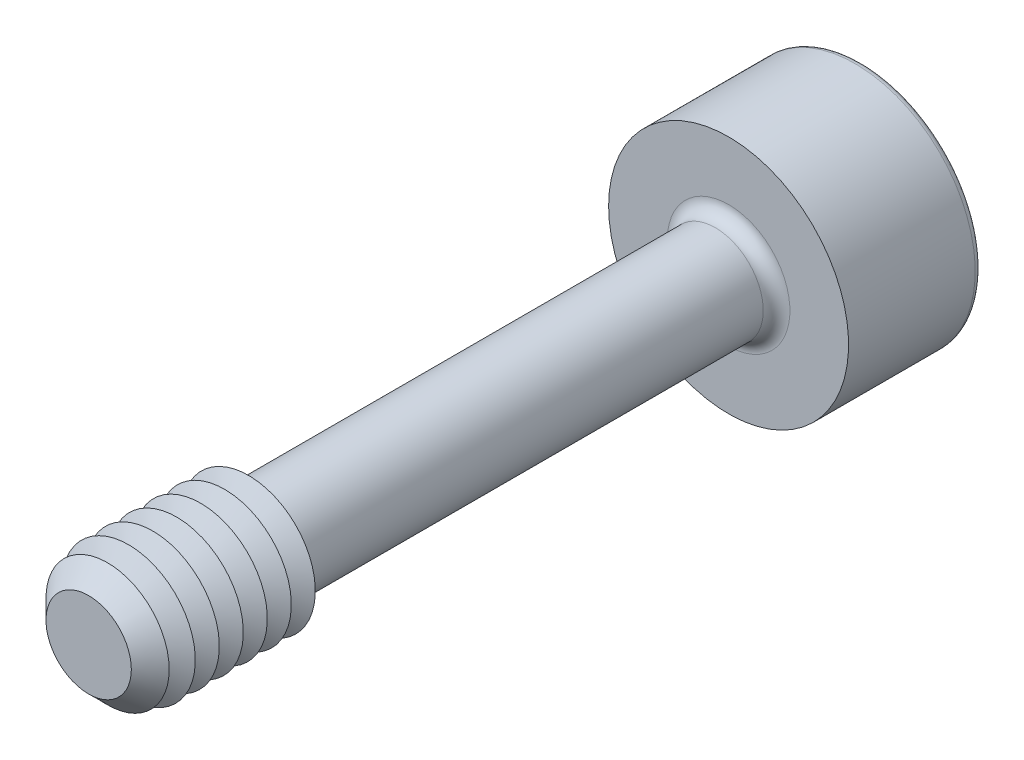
ISO-10303-21;
HEADER;
FILE_DESCRIPTION(('STEP AP214'),'2;1');
FILE_NAME('part.step','',(''),(''),'','','');
FILE_SCHEMA(('AUTOMOTIVE_DESIGN { 1 0 10303 214 1 1 1 1 }'));
ENDSEC;
DATA;
#1=APPLICATION_CONTEXT('core data for automotive mechanical design processes');
#2=APPLICATION_PROTOCOL_DEFINITION('international standard','automotive_design',2000,#1);
#3=PRODUCT_CONTEXT('',#1,'mechanical');
#4=PRODUCT('Part','Part','',(#3));
#5=PRODUCT_RELATED_PRODUCT_CATEGORY('part','',(#4));
#6=PRODUCT_DEFINITION_FORMATION('','',#4);
#7=PRODUCT_DEFINITION_CONTEXT('part definition',#1,'design');
#8=PRODUCT_DEFINITION('design','',#6,#7);
#9=PRODUCT_DEFINITION_SHAPE('','',#8);
#10=(LENGTH_UNIT() NAMED_UNIT(*) SI_UNIT(.MILLI.,.METRE.));
#11=(NAMED_UNIT(*) PLANE_ANGLE_UNIT() SI_UNIT($,.RADIAN.));
#12=(NAMED_UNIT(*) SI_UNIT($,.STERADIAN.) SOLID_ANGLE_UNIT());
#13=UNCERTAINTY_MEASURE_WITH_UNIT(LENGTH_MEASURE(1.E-05),#10,'distance_accuracy_value','');
#14=(GEOMETRIC_REPRESENTATION_CONTEXT(3) GLOBAL_UNCERTAINTY_ASSIGNED_CONTEXT((#13)) GLOBAL_UNIT_ASSIGNED_CONTEXT((#10,
#11,#12)) REPRESENTATION_CONTEXT('',''));
#15=CARTESIAN_POINT('',(0.,0.,0.));
#16=DIRECTION('',(0.,0.,1.));
#17=DIRECTION('',(1.,0.,0.));
#18=AXIS2_PLACEMENT_3D('',#15,#16,#17);
#19=CARTESIAN_POINT('',(-0.577350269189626,-0.999999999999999,-6.5));
#20=DIRECTION('',(0.,0.,1.));
#21=DIRECTION('',(1.,0.,0.));
#22=AXIS2_PLACEMENT_3D('',#19,#20,#21);
#23=PLANE('',#22);
#24=DIRECTION('',(1.,0.,0.));
#25=VECTOR('',#24,1.);
#26=CARTESIAN_POINT('',(-0.577350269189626,-0.999999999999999,-6.5));
#27=LINE('',#26,#25);
#28=CARTESIAN_POINT('',(0.,-0.999999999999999,-6.5));
#29=VERTEX_POINT('',#28);
#30=CARTESIAN_POINT('',(0.577350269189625,-0.999999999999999,-6.5));
#31=VERTEX_POINT('',#30);
#32=EDGE_CURVE('E693',#29,#31,#27,.T.);
#33=ORIENTED_EDGE('',*,*,#32,.F.);
#34=CARTESIAN_POINT('',(0.,0.,-6.5));
#35=DIRECTION('',(0.,0.,1.));
#36=DIRECTION('',(0.,-1.,0.));
#37=AXIS2_PLACEMENT_3D('',#34,#35,#36);
#38=CIRCLE('',#37,1.);
#39=CARTESIAN_POINT('',(0.866025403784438,-0.499999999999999,-6.5));
#40=VERTEX_POINT('',#39);
#41=EDGE_CURVE('E53',#29,#40,#38,.T.);
#42=ORIENTED_EDGE('',*,*,#41,.T.);
#43=DIRECTION('',(0.5,0.866025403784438,0.));
#44=VECTOR('',#43,1.);
#45=CARTESIAN_POINT('',(0.577350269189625,-0.999999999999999,-6.5));
#46=LINE('',#45,#44);
#47=EDGE_CURVE('E680',#31,#40,#46,.T.);
#48=ORIENTED_EDGE('',*,*,#47,.F.);
#49=EDGE_LOOP('',(#33,#42,#48));
#50=FACE_BOUND('',#49,.T.);
#51=ADVANCED_FACE('F41',(#50),#23,.F.);
#52=CARTESIAN_POINT('',(1.15470053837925,0.,-6.5));
#53=VERTEX_POINT('',#52);
#54=EDGE_CURVE('E689',#40,#53,#46,.T.);
#55=ORIENTED_EDGE('',*,*,#54,.F.);
#56=CARTESIAN_POINT('',(0.866025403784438,0.500000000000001,-6.5));
#57=VERTEX_POINT('',#56);
#58=EDGE_CURVE('E11',#40,#57,#38,.T.);
#59=ORIENTED_EDGE('',*,*,#58,.T.);
#60=DIRECTION('',(-0.5,0.866025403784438,0.));
#61=VECTOR('',#60,1.);
#62=CARTESIAN_POINT('',(1.15470053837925,0.,-6.5));
#63=LINE('',#62,#61);
#64=EDGE_CURVE('E679',#53,#57,#63,.T.);
#65=ORIENTED_EDGE('',*,*,#64,.F.);
#66=EDGE_LOOP('',(#55,#59,#65));
#67=FACE_BOUND('',#66,.T.);
#68=ADVANCED_FACE('F133',(#67),#23,.F.);
#69=CARTESIAN_POINT('',(0.577350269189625,1.,-6.5));
#70=VERTEX_POINT('',#69);
#71=EDGE_CURVE('E674',#57,#70,#63,.T.);
#72=ORIENTED_EDGE('',*,*,#71,.F.);
#73=CARTESIAN_POINT('',(0.,1.,-6.5));
#74=VERTEX_POINT('',#73);
#75=EDGE_CURVE('E51',#57,#74,#38,.T.);
#76=ORIENTED_EDGE('',*,*,#75,.T.);
#77=DIRECTION('',(-1.,0.,0.));
#78=VECTOR('',#77,1.);
#79=CARTESIAN_POINT('',(0.577350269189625,1.,-6.5));
#80=LINE('',#79,#78);
#81=EDGE_CURVE('E177',#70,#74,#80,.T.);
#82=ORIENTED_EDGE('',*,*,#81,.F.);
#83=EDGE_LOOP('',(#72,#76,#82));
#84=FACE_BOUND('',#83,.T.);
#85=ADVANCED_FACE('F139',(#84),#23,.F.);
#86=CARTESIAN_POINT('',(-0.577350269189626,1.,-6.5));
#87=VERTEX_POINT('',#86);
#88=EDGE_CURVE('E684',#74,#87,#80,.T.);
#89=ORIENTED_EDGE('',*,*,#88,.F.);
#90=CARTESIAN_POINT('',(-0.866025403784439,0.500000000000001,-6.5));
#91=VERTEX_POINT('',#90);
#92=EDGE_CURVE('E262',#74,#91,#38,.T.);
#93=ORIENTED_EDGE('',*,*,#92,.T.);
#94=DIRECTION('',(-0.5,-0.866025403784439,0.));
#95=VECTOR('',#94,1.);
#96=CARTESIAN_POINT('',(-0.577350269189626,1.,-6.5));
#97=LINE('',#96,#95);
#98=EDGE_CURVE('E176',#87,#91,#97,.T.);
#99=ORIENTED_EDGE('',*,*,#98,.F.);
#100=EDGE_LOOP('',(#89,#93,#99));
#101=FACE_BOUND('',#100,.T.);
#102=ADVANCED_FACE('F157',(#101),#23,.F.);
#103=CARTESIAN_POINT('',(-1.15470053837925,0.,-6.5));
#104=VERTEX_POINT('',#103);
#105=EDGE_CURVE('E170',#91,#104,#97,.T.);
#106=ORIENTED_EDGE('',*,*,#105,.F.);
#107=CARTESIAN_POINT('',(-0.866025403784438,-0.5,-6.5));
#108=VERTEX_POINT('',#107);
#109=EDGE_CURVE('E172',#91,#108,#38,.T.);
#110=ORIENTED_EDGE('',*,*,#109,.T.);
#111=DIRECTION('',(0.500000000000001,-0.866025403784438,0.));
#112=VECTOR('',#111,1.);
#113=CARTESIAN_POINT('',(-1.15470053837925,0.,-6.5));
#114=LINE('',#113,#112);
#115=EDGE_CURVE('E174',#104,#108,#114,.T.);
#116=ORIENTED_EDGE('',*,*,#115,.F.);
#117=EDGE_LOOP('',(#106,#110,#116));
#118=FACE_BOUND('',#117,.T.);
#119=ADVANCED_FACE('F146',(#118),#23,.F.);
#120=CARTESIAN_POINT('',(0.,0.,-8.5));
#121=DIRECTION('',(0.,0.,-1.));
#122=DIRECTION('',(-1.,0.,0.));
#123=AXIS2_PLACEMENT_3D('',#120,#121,#122);
#124=PLANE('',#123);
#125=CARTESIAN_POINT('',(0.,0.,-8.5));
#126=DIRECTION('',(0.,0.,-1.));
#127=DIRECTION('',(-1.,0.,0.));
#128=AXIS2_PLACEMENT_3D('',#125,#126,#127);
#129=CIRCLE('',#128,2.125);
#130=CARTESIAN_POINT('',(-2.125,0.,-8.5));
#131=VERTEX_POINT('',#130);
#132=EDGE_CURVE('E251',#131,#131,#129,.T.);
#133=ORIENTED_EDGE('',*,*,#132,.T.);
#134=EDGE_LOOP('',(#133));
#135=FACE_BOUND('',#134,.T.);
#136=DIRECTION('',(-0.5,-0.866025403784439,0.));
#137=VECTOR('',#136,1.);
#138=CARTESIAN_POINT('',(-0.577350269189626,1.,-8.5));
#139=LINE('',#138,#137);
#140=CARTESIAN_POINT('',(-0.577350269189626,1.,-8.5));
#141=VERTEX_POINT('',#140);
#142=CARTESIAN_POINT('',(-1.15470053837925,0.,-8.5));
#143=VERTEX_POINT('',#142);
#144=EDGE_CURVE('E212',#141,#143,#139,.T.);
#145=ORIENTED_EDGE('',*,*,#144,.T.);
#146=DIRECTION('',(0.500000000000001,-0.866025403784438,0.));
#147=VECTOR('',#146,1.);
#148=CARTESIAN_POINT('',(-1.15470053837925,0.,-8.5));
#149=LINE('',#148,#147);
#150=CARTESIAN_POINT('',(-0.577350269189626,-0.999999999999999,-8.5));
#151=VERTEX_POINT('',#150);
#152=EDGE_CURVE('E67',#143,#151,#149,.T.);
#153=ORIENTED_EDGE('',*,*,#152,.T.);
#154=DIRECTION('',(1.,0.,0.));
#155=VECTOR('',#154,1.);
#156=CARTESIAN_POINT('',(-0.577350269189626,-0.999999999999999,-8.5));
#157=LINE('',#156,#155);
#158=CARTESIAN_POINT('',(0.577350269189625,-0.999999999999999,-8.5));
#159=VERTEX_POINT('',#158);
#160=EDGE_CURVE('E196',#151,#159,#157,.T.);
#161=ORIENTED_EDGE('',*,*,#160,.T.);
#162=DIRECTION('',(0.5,0.866025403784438,0.));
#163=VECTOR('',#162,1.);
#164=CARTESIAN_POINT('',(0.577350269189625,-0.999999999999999,-8.5));
#165=LINE('',#164,#163);
#166=CARTESIAN_POINT('',(1.15470053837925,0.,-8.5));
#167=VERTEX_POINT('',#166);
#168=EDGE_CURVE('E200',#159,#167,#165,.T.);
#169=ORIENTED_EDGE('',*,*,#168,.T.);
#170=DIRECTION('',(-0.5,0.866025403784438,0.));
#171=VECTOR('',#170,1.);
#172=CARTESIAN_POINT('',(1.15470053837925,0.,-8.5));
#173=LINE('',#172,#171);
#174=CARTESIAN_POINT('',(0.577350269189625,1.,-8.5));
#175=VERTEX_POINT('',#174);
#176=EDGE_CURVE('E204',#167,#175,#173,.T.);
#177=ORIENTED_EDGE('',*,*,#176,.T.);
#178=DIRECTION('',(-1.,0.,0.));
#179=VECTOR('',#178,1.);
#180=CARTESIAN_POINT('',(0.577350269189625,1.,-8.5));
#181=LINE('',#180,#179);
#182=EDGE_CURVE('E208',#175,#141,#181,.T.);
#183=ORIENTED_EDGE('',*,*,#182,.T.);
#184=EDGE_LOOP('',(#145,#153,#161,#169,#177,#183));
#185=FACE_BOUND('',#184,.T.);
#186=ADVANCED_FACE('F156',(#135,#185),#124,.T.);
#187=CARTESIAN_POINT('',(0.,0.,6.));
#188=DIRECTION('',(0.,0.,-1.));
#189=DIRECTION('',(-1.,0.,0.));
#190=AXIS2_PLACEMENT_3D('',#187,#188,#189);
#191=CYLINDRICAL_SURFACE('',#190,0.9);
#192=CARTESIAN_POINT('',(0.,0.,-5.75));
#193=DIRECTION('',(0.,0.,-1.));
#194=DIRECTION('',(-1.,0.,0.));
#195=AXIS2_PLACEMENT_3D('',#192,#193,#194);
#196=CIRCLE('',#195,0.9);
#197=CARTESIAN_POINT('',(-0.9,0.,-5.75));
#198=VERTEX_POINT('',#197);
#199=EDGE_CURVE('E247',#198,#198,#196,.F.);
#200=ORIENTED_EDGE('',*,*,#199,.T.);
#201=EDGE_LOOP('',(#200));
#202=FACE_BOUND('',#201,.T.);
#203=CARTESIAN_POINT('',(0.,0.,2.79792740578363));
#204=DIRECTION('',(0.,0.,-1.));
#205=DIRECTION('',(0.,1.,0.));
#206=AXIS2_PLACEMENT_3D('',#203,#204,#205);
#207=CIRCLE('',#206,0.9);
#208=CARTESIAN_POINT('',(0.,0.9,2.79792740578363));
#209=VERTEX_POINT('',#208);
#210=EDGE_CURVE('E235',#209,#209,#207,.T.);
#211=ORIENTED_EDGE('',*,*,#210,.T.);
#212=EDGE_LOOP('',(#211));
#213=FACE_BOUND('',#212,.T.);
#214=ADVANCED_FACE('F163',(#202,#213),#191,.T.);
#215=CARTESIAN_POINT('',(0.,0.,2.79792740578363));
#216=DIRECTION('',(0.,0.,1.));
#217=DIRECTION('',(0.,-1.,0.));
#218=AXIS2_PLACEMENT_3D('',#215,#216,#217);
#219=CONICAL_SURFACE('',#218,0.9,1.0471975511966);
#220=CARTESIAN_POINT('',(0.,0.,3.));
#221=DIRECTION('',(0.,0.,-1.));
#222=DIRECTION('',(-1.,0.,0.));
#223=AXIS2_PLACEMENT_3D('',#220,#221,#222);
#224=CIRCLE('',#223,1.25);
#225=CARTESIAN_POINT('',(-1.25,0.,3.));
#226=VERTEX_POINT('',#225);
#227=EDGE_CURVE('E266',#226,#226,#224,.T.);
#228=ORIENTED_EDGE('',*,*,#227,.T.);
#229=EDGE_LOOP('',(#228));
#230=FACE_BOUND('',#229,.T.);
#231=ORIENTED_EDGE('',*,*,#210,.F.);
#232=EDGE_LOOP('',(#231));
#233=FACE_BOUND('',#232,.T.);
#234=ADVANCED_FACE('F459',(#230,#233),#219,.T.);
#235=CARTESIAN_POINT('',(0.,0.,-6.));
#236=DIRECTION('',(0.,0.,-1.));
#237=DIRECTION('',(-1.,0.,0.));
#238=AXIS2_PLACEMENT_3D('',#235,#236,#237);
#239=PLANE('',#238);
#240=CARTESIAN_POINT('',(0.,0.,-6.));
#241=DIRECTION('',(0.,0.,-1.));
#242=DIRECTION('',(-1.,0.,0.));
#243=AXIS2_PLACEMENT_3D('',#240,#241,#242);
#244=CIRCLE('',#243,1.15);
#245=CARTESIAN_POINT('',(-1.15,0.,-6.));
#246=VERTEX_POINT('',#245);
#247=EDGE_CURVE('E243',#246,#246,#244,.T.);
#248=ORIENTED_EDGE('',*,*,#247,.T.);
#249=EDGE_LOOP('',(#248));
#250=FACE_BOUND('',#249,.T.);
#251=CARTESIAN_POINT('',(0.,0.,-6.));
#252=DIRECTION('',(0.,0.,-1.));
#253=DIRECTION('',(-1.,0.,0.));
#254=AXIS2_PLACEMENT_3D('',#251,#252,#253);
#255=CIRCLE('',#254,2.25);
#256=CARTESIAN_POINT('',(-2.25,0.,-6.));
#257=VERTEX_POINT('',#256);
#258=EDGE_CURVE('E231',#257,#257,#255,.T.);
#259=ORIENTED_EDGE('',*,*,#258,.F.);
#260=EDGE_LOOP('',(#259));
#261=FACE_BOUND('',#260,.T.);
#262=ADVANCED_FACE('F452',(#250,#261),#239,.F.);
#263=CARTESIAN_POINT('',(0.,0.,-8.5));
#264=DIRECTION('',(0.,0.,1.));
#265=DIRECTION('',(1.,0.,0.));
#266=AXIS2_PLACEMENT_3D('',#263,#264,#265);
#267=CYLINDRICAL_SURFACE('',#266,2.25);
#268=CARTESIAN_POINT('',(0.,0.,-8.375));
#269=DIRECTION('',(0.,0.,-1.));
#270=DIRECTION('',(-1.,0.,0.));
#271=AXIS2_PLACEMENT_3D('',#268,#269,#270);
#272=CIRCLE('',#271,2.25);
#273=CARTESIAN_POINT('',(-2.25,0.,-8.375));
#274=VERTEX_POINT('',#273);
#275=EDGE_CURVE('E254',#274,#274,#272,.F.);
#276=ORIENTED_EDGE('',*,*,#275,.T.);
#277=EDGE_LOOP('',(#276));
#278=FACE_BOUND('',#277,.T.);
#279=ORIENTED_EDGE('',*,*,#258,.T.);
#280=EDGE_LOOP('',(#279));
#281=FACE_BOUND('',#280,.T.);
#282=ADVANCED_FACE('F458',(#278,#281),#267,.T.);
#283=CARTESIAN_POINT('',(-1.15470053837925,0.,-6.5));
#284=DIRECTION('',(0.866025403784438,0.500000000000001,0.));
#285=DIRECTION('',(-0.500000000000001,0.866025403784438,0.));
#286=AXIS2_PLACEMENT_3D('',#283,#284,#285);
#287=PLANE('',#286);
#288=ORIENTED_EDGE('',*,*,#152,.F.);
#289=DIRECTION('',(0.,0.,-1.));
#290=VECTOR('',#289,1.);
#291=CARTESIAN_POINT('',(-1.15470053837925,0.,-6.5));
#292=LINE('',#291,#290);
#293=EDGE_CURVE('E186',#104,#143,#292,.T.);
#294=ORIENTED_EDGE('',*,*,#293,.F.);
#295=ORIENTED_EDGE('',*,*,#115,.T.);
#296=CARTESIAN_POINT('',(-0.577350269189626,-0.999999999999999,-6.5));
#297=VERTEX_POINT('',#296);
#298=EDGE_CURVE('E215',#108,#297,#114,.T.);
#299=ORIENTED_EDGE('',*,*,#298,.T.);
#300=DIRECTION('',(0.,0.,-1.));
#301=VECTOR('',#300,1.);
#302=CARTESIAN_POINT('',(-0.577350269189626,-0.999999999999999,-6.5));
#303=LINE('',#302,#301);
#304=EDGE_CURVE('E228',#297,#151,#303,.T.);
#305=ORIENTED_EDGE('',*,*,#304,.T.);
#306=EDGE_LOOP('',(#288,#294,#295,#299,#305));
#307=FACE_BOUND('',#306,.T.);
#308=ADVANCED_FACE('F470',(#307),#287,.T.);
#309=CARTESIAN_POINT('',(-0.577350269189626,-0.999999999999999,-6.5));
#310=DIRECTION('',(0.,1.,0.));
#311=DIRECTION('',(-1.,0.,0.));
#312=AXIS2_PLACEMENT_3D('',#309,#310,#311);
#313=PLANE('',#312);
#314=ORIENTED_EDGE('',*,*,#160,.F.);
#315=ORIENTED_EDGE('',*,*,#304,.F.);
#316=EDGE_CURVE('E690',#297,#29,#27,.T.);
#317=ORIENTED_EDGE('',*,*,#316,.T.);
#318=ORIENTED_EDGE('',*,*,#32,.T.);
#319=DIRECTION('',(0.,0.,-1.));
#320=VECTOR('',#319,1.);
#321=CARTESIAN_POINT('',(0.577350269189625,-0.999999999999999,-6.5));
#322=LINE('',#321,#320);
#323=EDGE_CURVE('E225',#31,#159,#322,.T.);
#324=ORIENTED_EDGE('',*,*,#323,.T.);
#325=EDGE_LOOP('',(#314,#315,#317,#318,#324));
#326=FACE_BOUND('',#325,.T.);
#327=ADVANCED_FACE('F486',(#326),#313,.T.);
#328=CARTESIAN_POINT('',(0.577350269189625,-0.999999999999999,-6.5));
#329=DIRECTION('',(-0.866025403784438,0.5,0.));
#330=DIRECTION('',(-0.5,-0.866025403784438,0.));
#331=AXIS2_PLACEMENT_3D('',#328,#329,#330);
#332=PLANE('',#331);
#333=ORIENTED_EDGE('',*,*,#168,.F.);
#334=ORIENTED_EDGE('',*,*,#323,.F.);
#335=ORIENTED_EDGE('',*,*,#47,.T.);
#336=ORIENTED_EDGE('',*,*,#54,.T.);
#337=DIRECTION('',(0.,0.,-1.));
#338=VECTOR('',#337,1.);
#339=CARTESIAN_POINT('',(1.15470053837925,0.,-6.5));
#340=LINE('',#339,#338);
#341=EDGE_CURVE('E222',#53,#167,#340,.T.);
#342=ORIENTED_EDGE('',*,*,#341,.T.);
#343=EDGE_LOOP('',(#333,#334,#335,#336,#342));
#344=FACE_BOUND('',#343,.T.);
#345=ADVANCED_FACE('F496',(#344),#332,.T.);
#346=CARTESIAN_POINT('',(1.15470053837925,0.,-6.5));
#347=DIRECTION('',(-0.866025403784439,-0.5,0.));
#348=DIRECTION('',(0.5,-0.866025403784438,0.));
#349=AXIS2_PLACEMENT_3D('',#346,#347,#348);
#350=PLANE('',#349);
#351=ORIENTED_EDGE('',*,*,#176,.F.);
#352=ORIENTED_EDGE('',*,*,#341,.F.);
#353=ORIENTED_EDGE('',*,*,#64,.T.);
#354=ORIENTED_EDGE('',*,*,#71,.T.);
#355=DIRECTION('',(0.,0.,-1.));
#356=VECTOR('',#355,1.);
#357=CARTESIAN_POINT('',(0.577350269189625,1.,-6.5));
#358=LINE('',#357,#356);
#359=EDGE_CURVE('E219',#70,#175,#358,.T.);
#360=ORIENTED_EDGE('',*,*,#359,.T.);
#361=EDGE_LOOP('',(#351,#352,#353,#354,#360));
#362=FACE_BOUND('',#361,.T.);
#363=ADVANCED_FACE('F506',(#362),#350,.T.);
#364=CARTESIAN_POINT('',(0.577350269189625,1.,-6.5));
#365=DIRECTION('',(0.,-1.,0.));
#366=DIRECTION('',(1.,0.,0.));
#367=AXIS2_PLACEMENT_3D('',#364,#365,#366);
#368=PLANE('',#367);
#369=ORIENTED_EDGE('',*,*,#182,.F.);
#370=ORIENTED_EDGE('',*,*,#359,.F.);
#371=ORIENTED_EDGE('',*,*,#81,.T.);
#372=ORIENTED_EDGE('',*,*,#88,.T.);
#373=DIRECTION('',(0.,0.,-1.));
#374=VECTOR('',#373,1.);
#375=CARTESIAN_POINT('',(-0.577350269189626,1.,-6.5));
#376=LINE('',#375,#374);
#377=EDGE_CURVE('E182',#87,#141,#376,.T.);
#378=ORIENTED_EDGE('',*,*,#377,.T.);
#379=EDGE_LOOP('',(#369,#370,#371,#372,#378));
#380=FACE_BOUND('',#379,.T.);
#381=ADVANCED_FACE('F152',(#380),#368,.T.);
#382=CARTESIAN_POINT('',(-0.577350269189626,1.,-6.5));
#383=DIRECTION('',(0.866025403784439,-0.5,0.));
#384=DIRECTION('',(0.5,0.866025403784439,0.));
#385=AXIS2_PLACEMENT_3D('',#382,#383,#384);
#386=PLANE('',#385);
#387=ORIENTED_EDGE('',*,*,#144,.F.);
#388=ORIENTED_EDGE('',*,*,#377,.F.);
#389=ORIENTED_EDGE('',*,*,#98,.T.);
#390=ORIENTED_EDGE('',*,*,#105,.T.);
#391=ORIENTED_EDGE('',*,*,#293,.T.);
#392=EDGE_LOOP('',(#387,#388,#389,#390,#391));
#393=FACE_BOUND('',#392,.T.);
#394=ADVANCED_FACE('F144',(#393),#386,.T.);
#395=ORIENTED_EDGE('',*,*,#298,.F.);
#396=EDGE_CURVE('E256',#108,#29,#38,.T.);
#397=ORIENTED_EDGE('',*,*,#396,.T.);
#398=ORIENTED_EDGE('',*,*,#316,.F.);
#399=EDGE_LOOP('',(#395,#397,#398));
#400=FACE_BOUND('',#399,.T.);
#401=ADVANCED_FACE('F135',(#400),#23,.F.);
#402=CARTESIAN_POINT('',(0.,0.,-5.75));
#403=DIRECTION('',(0.,0.,-1.));
#404=DIRECTION('',(-1.,0.,0.));
#405=AXIS2_PLACEMENT_3D('',#402,#403,#404);
#406=TOROIDAL_SURFACE('',#405,1.15,0.25);
#407=ORIENTED_EDGE('',*,*,#199,.F.);
#408=EDGE_LOOP('',(#407));
#409=FACE_BOUND('',#408,.T.);
#410=ORIENTED_EDGE('',*,*,#247,.F.);
#411=EDGE_LOOP('',(#410));
#412=FACE_BOUND('',#411,.T.);
#413=ADVANCED_FACE('F129',(#409,#412),#406,.F.);
#414=CARTESIAN_POINT('',(0.,0.,-8.375));
#415=DIRECTION('',(0.,0.,-1.));
#416=DIRECTION('',(-1.,0.,0.));
#417=AXIS2_PLACEMENT_3D('',#414,#415,#416);
#418=TOROIDAL_SURFACE('',#417,2.125,0.125);
#419=ORIENTED_EDGE('',*,*,#275,.F.);
#420=EDGE_LOOP('',(#419));
#421=FACE_BOUND('',#420,.T.);
#422=ORIENTED_EDGE('',*,*,#132,.F.);
#423=EDGE_LOOP('',(#422));
#424=FACE_BOUND('',#423,.T.);
#425=ADVANCED_FACE('F43',(#421,#424),#418,.T.);
#426=CARTESIAN_POINT('',(0.,0.,-5.92264973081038));
#427=DIRECTION('',(0.,0.,-1.));
#428=DIRECTION('',(0.,1.,0.));
#429=AXIS2_PLACEMENT_3D('',#426,#427,#428);
#430=CONICAL_SURFACE('',#429,0.,1.04719755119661);
#431=ORIENTED_EDGE('',*,*,#41,.F.);
#432=ORIENTED_EDGE('',*,*,#396,.F.);
#433=ORIENTED_EDGE('',*,*,#109,.F.);
#434=ORIENTED_EDGE('',*,*,#92,.F.);
#435=ORIENTED_EDGE('',*,*,#75,.F.);
#436=ORIENTED_EDGE('',*,*,#58,.F.);
#437=EDGE_LOOP('',(#431,#432,#433,#434,#435,#436));
#438=FACE_BOUND('',#437,.T.);
#439=CARTESIAN_POINT('',(0.,0.,-5.92264973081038));
#440=VERTEX_POINT('',#439);
#441=VERTEX_LOOP('',#440);
#442=FACE_BOUND('',#441,.T.);
#443=ADVANCED_FACE('F118',(#438,#442),#430,.F.);
#444=CARTESIAN_POINT('',(0.,0.,3.225));
#445=DIRECTION('',(0.,0.,-1.));
#446=DIRECTION('',(-1.,0.,0.));
#447=AXIS2_PLACEMENT_3D('',#444,#445,#446);
#448=CONICAL_SURFACE('',#447,0.860288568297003,1.0471975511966);
#449=ORIENTED_EDGE('',*,*,#227,.F.);
#450=EDGE_LOOP('',(#449));
#451=FACE_BOUND('',#450,.T.);
#452=CARTESIAN_POINT('',(0.,0.,3.225));
#453=DIRECTION('',(0.,0.,-1.));
#454=DIRECTION('',(-1.,0.,0.));
#455=AXIS2_PLACEMENT_3D('',#452,#453,#454);
#456=CIRCLE('',#455,0.860288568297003);
#457=CARTESIAN_POINT('',(-0.860288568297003,0.,3.225));
#458=VERTEX_POINT('',#457);
#459=EDGE_CURVE('E273',#458,#458,#456,.T.);
#460=ORIENTED_EDGE('',*,*,#459,.T.);
#461=EDGE_LOOP('',(#460));
#462=FACE_BOUND('',#461,.T.);
#463=ADVANCED_FACE('F120',(#451,#462),#448,.T.);
#464=CARTESIAN_POINT('',(0.,0.,3.45));
#465=DIRECTION('',(0.,0.,1.));
#466=DIRECTION('',(1.,0.,0.));
#467=AXIS2_PLACEMENT_3D('',#464,#465,#466);
#468=CONICAL_SURFACE('',#467,1.25,1.0471975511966);
#469=ORIENTED_EDGE('',*,*,#459,.F.);
#470=EDGE_LOOP('',(#469));
#471=FACE_BOUND('',#470,.T.);
#472=CARTESIAN_POINT('',(0.,0.,3.45));
#473=DIRECTION('',(0.,0.,-1.));
#474=DIRECTION('',(-1.,0.,0.));
#475=AXIS2_PLACEMENT_3D('',#472,#473,#474);
#476=CIRCLE('',#475,1.25);
#477=CARTESIAN_POINT('',(-1.25,0.,3.45));
#478=VERTEX_POINT('',#477);
#479=EDGE_CURVE('E278',#478,#478,#476,.T.);
#480=ORIENTED_EDGE('',*,*,#479,.T.);
#481=EDGE_LOOP('',(#480));
#482=FACE_BOUND('',#481,.T.);
#483=ADVANCED_FACE('F126',(#471,#482),#468,.T.);
#484=CARTESIAN_POINT('',(0.,0.,3.675));
#485=DIRECTION('',(0.,0.,-1.));
#486=DIRECTION('',(-1.,0.,0.));
#487=AXIS2_PLACEMENT_3D('',#484,#485,#486);
#488=CONICAL_SURFACE('',#487,0.860288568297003,1.0471975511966);
#489=ORIENTED_EDGE('',*,*,#479,.F.);
#490=EDGE_LOOP('',(#489));
#491=FACE_BOUND('',#490,.T.);
#492=CARTESIAN_POINT('',(0.,0.,3.675));
#493=DIRECTION('',(0.,0.,-1.));
#494=DIRECTION('',(-1.,0.,0.));
#495=AXIS2_PLACEMENT_3D('',#492,#493,#494);
#496=CIRCLE('',#495,0.860288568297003);
#497=CARTESIAN_POINT('',(-0.860288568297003,0.,3.675));
#498=VERTEX_POINT('',#497);
#499=EDGE_CURVE('E284',#498,#498,#496,.T.);
#500=ORIENTED_EDGE('',*,*,#499,.T.);
#501=EDGE_LOOP('',(#500));
#502=FACE_BOUND('',#501,.T.);
#503=ADVANCED_FACE('F366',(#491,#502),#488,.T.);
#504=CARTESIAN_POINT('',(0.,0.,3.9));
#505=DIRECTION('',(0.,0.,1.));
#506=DIRECTION('',(1.,0.,0.));
#507=AXIS2_PLACEMENT_3D('',#504,#505,#506);
#508=CONICAL_SURFACE('',#507,1.25,1.0471975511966);
#509=ORIENTED_EDGE('',*,*,#499,.F.);
#510=EDGE_LOOP('',(#509));
#511=FACE_BOUND('',#510,.T.);
#512=CARTESIAN_POINT('',(0.,0.,3.9));
#513=DIRECTION('',(0.,0.,-1.));
#514=DIRECTION('',(-1.,0.,0.));
#515=AXIS2_PLACEMENT_3D('',#512,#513,#514);
#516=CIRCLE('',#515,1.25);
#517=CARTESIAN_POINT('',(-1.25,0.,3.9));
#518=VERTEX_POINT('',#517);
#519=EDGE_CURVE('E288',#518,#518,#516,.T.);
#520=ORIENTED_EDGE('',*,*,#519,.T.);
#521=EDGE_LOOP('',(#520));
#522=FACE_BOUND('',#521,.T.);
#523=ADVANCED_FACE('F362',(#511,#522),#508,.T.);
#524=CARTESIAN_POINT('',(0.,0.,4.125));
#525=DIRECTION('',(0.,0.,-1.));
#526=DIRECTION('',(-1.,0.,0.));
#527=AXIS2_PLACEMENT_3D('',#524,#525,#526);
#528=CONICAL_SURFACE('',#527,0.860288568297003,1.0471975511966);
#529=ORIENTED_EDGE('',*,*,#519,.F.);
#530=EDGE_LOOP('',(#529));
#531=FACE_BOUND('',#530,.T.);
#532=CARTESIAN_POINT('',(0.,0.,4.125));
#533=DIRECTION('',(0.,0.,-1.));
#534=DIRECTION('',(-1.,0.,0.));
#535=AXIS2_PLACEMENT_3D('',#532,#533,#534);
#536=CIRCLE('',#535,0.860288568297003);
#537=CARTESIAN_POINT('',(-0.860288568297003,0.,4.125));
#538=VERTEX_POINT('',#537);
#539=EDGE_CURVE('E292',#538,#538,#536,.T.);
#540=ORIENTED_EDGE('',*,*,#539,.T.);
#541=EDGE_LOOP('',(#540));
#542=FACE_BOUND('',#541,.T.);
#543=ADVANCED_FACE('F358',(#531,#542),#528,.T.);
#544=CARTESIAN_POINT('',(0.,0.,4.35));
#545=DIRECTION('',(0.,0.,1.));
#546=DIRECTION('',(1.,0.,0.));
#547=AXIS2_PLACEMENT_3D('',#544,#545,#546);
#548=CONICAL_SURFACE('',#547,1.25,1.0471975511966);
#549=ORIENTED_EDGE('',*,*,#539,.F.);
#550=EDGE_LOOP('',(#549));
#551=FACE_BOUND('',#550,.T.);
#552=CARTESIAN_POINT('',(0.,0.,4.35));
#553=DIRECTION('',(0.,0.,-1.));
#554=DIRECTION('',(-1.,0.,0.));
#555=AXIS2_PLACEMENT_3D('',#552,#553,#554);
#556=CIRCLE('',#555,1.25);
#557=CARTESIAN_POINT('',(-1.25,0.,4.35));
#558=VERTEX_POINT('',#557);
#559=EDGE_CURVE('E296',#558,#558,#556,.T.);
#560=ORIENTED_EDGE('',*,*,#559,.T.);
#561=EDGE_LOOP('',(#560));
#562=FACE_BOUND('',#561,.T.);
#563=ADVANCED_FACE('F354',(#551,#562),#548,.T.);
#564=CARTESIAN_POINT('',(0.,0.,4.575));
#565=DIRECTION('',(0.,0.,-1.));
#566=DIRECTION('',(-1.,0.,0.));
#567=AXIS2_PLACEMENT_3D('',#564,#565,#566);
#568=CONICAL_SURFACE('',#567,0.860288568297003,1.0471975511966);
#569=ORIENTED_EDGE('',*,*,#559,.F.);
#570=EDGE_LOOP('',(#569));
#571=FACE_BOUND('',#570,.T.);
#572=CARTESIAN_POINT('',(0.,0.,4.575));
#573=DIRECTION('',(0.,0.,-1.));
#574=DIRECTION('',(-1.,0.,0.));
#575=AXIS2_PLACEMENT_3D('',#572,#573,#574);
#576=CIRCLE('',#575,0.860288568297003);
#577=CARTESIAN_POINT('',(-0.860288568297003,0.,4.575));
#578=VERTEX_POINT('',#577);
#579=EDGE_CURVE('E300',#578,#578,#576,.T.);
#580=ORIENTED_EDGE('',*,*,#579,.T.);
#581=EDGE_LOOP('',(#580));
#582=FACE_BOUND('',#581,.T.);
#583=ADVANCED_FACE('F350',(#571,#582),#568,.T.);
#584=CARTESIAN_POINT('',(0.,0.,4.8));
#585=DIRECTION('',(0.,0.,1.));
#586=DIRECTION('',(1.,0.,0.));
#587=AXIS2_PLACEMENT_3D('',#584,#585,#586);
#588=CONICAL_SURFACE('',#587,1.25,1.0471975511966);
#589=ORIENTED_EDGE('',*,*,#579,.F.);
#590=EDGE_LOOP('',(#589));
#591=FACE_BOUND('',#590,.T.);
#592=CARTESIAN_POINT('',(0.,0.,4.8));
#593=DIRECTION('',(0.,0.,-1.));
#594=DIRECTION('',(-1.,0.,0.));
#595=AXIS2_PLACEMENT_3D('',#592,#593,#594);
#596=CIRCLE('',#595,1.25);
#597=CARTESIAN_POINT('',(-1.25,0.,4.8));
#598=VERTEX_POINT('',#597);
#599=EDGE_CURVE('E304',#598,#598,#596,.T.);
#600=ORIENTED_EDGE('',*,*,#599,.T.);
#601=EDGE_LOOP('',(#600));
#602=FACE_BOUND('',#601,.T.);
#603=ADVANCED_FACE('F346',(#591,#602),#588,.T.);
#604=CARTESIAN_POINT('',(0.,0.,5.025));
#605=DIRECTION('',(0.,0.,-1.));
#606=DIRECTION('',(-1.,0.,0.));
#607=AXIS2_PLACEMENT_3D('',#604,#605,#606);
#608=CONICAL_SURFACE('',#607,0.860288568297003,1.0471975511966);
#609=ORIENTED_EDGE('',*,*,#599,.F.);
#610=EDGE_LOOP('',(#609));
#611=FACE_BOUND('',#610,.T.);
#612=CARTESIAN_POINT('',(0.,0.,5.025));
#613=DIRECTION('',(0.,0.,-1.));
#614=DIRECTION('',(-1.,0.,0.));
#615=AXIS2_PLACEMENT_3D('',#612,#613,#614);
#616=CIRCLE('',#615,0.860288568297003);
#617=CARTESIAN_POINT('',(-0.860288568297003,0.,5.025));
#618=VERTEX_POINT('',#617);
#619=EDGE_CURVE('E308',#618,#618,#616,.T.);
#620=ORIENTED_EDGE('',*,*,#619,.T.);
#621=EDGE_LOOP('',(#620));
#622=FACE_BOUND('',#621,.T.);
#623=ADVANCED_FACE('F342',(#611,#622),#608,.T.);
#624=CARTESIAN_POINT('',(0.,0.,5.25));
#625=DIRECTION('',(0.,0.,1.));
#626=DIRECTION('',(1.,0.,0.));
#627=AXIS2_PLACEMENT_3D('',#624,#625,#626);
#628=CONICAL_SURFACE('',#627,1.25,1.0471975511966);
#629=ORIENTED_EDGE('',*,*,#619,.F.);
#630=EDGE_LOOP('',(#629));
#631=FACE_BOUND('',#630,.T.);
#632=CARTESIAN_POINT('',(0.,0.,5.25));
#633=DIRECTION('',(0.,0.,-1.));
#634=DIRECTION('',(-1.,0.,0.));
#635=AXIS2_PLACEMENT_3D('',#632,#633,#634);
#636=CIRCLE('',#635,1.25);
#637=CARTESIAN_POINT('',(-1.25,0.,5.25));
#638=VERTEX_POINT('',#637);
#639=EDGE_CURVE('E311',#638,#638,#636,.T.);
#640=ORIENTED_EDGE('',*,*,#639,.T.);
#641=EDGE_LOOP('',(#640));
#642=FACE_BOUND('',#641,.T.);
#643=ADVANCED_FACE('F335',(#631,#642),#628,.T.);
#644=CARTESIAN_POINT('',(0.,0.,5.475));
#645=DIRECTION('',(0.,0.,-1.));
#646=DIRECTION('',(-1.,0.,0.));
#647=AXIS2_PLACEMENT_3D('',#644,#645,#646);
#648=CONICAL_SURFACE('',#647,0.860288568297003,1.0471975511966);
#649=ORIENTED_EDGE('',*,*,#639,.F.);
#650=EDGE_LOOP('',(#649));
#651=FACE_BOUND('',#650,.T.);
#652=CARTESIAN_POINT('',(0.,0.,5.475));
#653=DIRECTION('',(0.,0.,-1.));
#654=DIRECTION('',(-1.,0.,0.));
#655=AXIS2_PLACEMENT_3D('',#652,#653,#654);
#656=CIRCLE('',#655,0.860288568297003);
#657=CARTESIAN_POINT('',(-0.860288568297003,0.,5.475));
#658=VERTEX_POINT('',#657);
#659=EDGE_CURVE('E315',#658,#658,#656,.T.);
#660=ORIENTED_EDGE('',*,*,#659,.T.);
#661=EDGE_LOOP('',(#660));
#662=FACE_BOUND('',#661,.T.);
#663=ADVANCED_FACE('F321',(#651,#662),#648,.T.);
#664=CARTESIAN_POINT('',(0.,0.,5.7));
#665=DIRECTION('',(0.,0.,1.));
#666=DIRECTION('',(1.,0.,0.));
#667=AXIS2_PLACEMENT_3D('',#664,#665,#666);
#668=CONICAL_SURFACE('',#667,1.25,1.0471975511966);
#669=CARTESIAN_POINT('',(0.,0.,5.64509618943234));
#670=DIRECTION('',(0.,0.,1.));
#671=DIRECTION('',(1.,0.,0.));
#672=AXIS2_PLACEMENT_3D('',#669,#670,#671);
#673=CIRCLE('',#672,1.15490381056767);
#674=CARTESIAN_POINT('',(1.15490381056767,0.,5.64509618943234));
#675=VERTEX_POINT('',#674);
#676=EDGE_CURVE('E45',#675,#675,#673,.F.);
#677=ORIENTED_EDGE('',*,*,#676,.T.);
#678=EDGE_LOOP('',(#677));
#679=FACE_BOUND('',#678,.T.);
#680=ORIENTED_EDGE('',*,*,#659,.F.);
#681=EDGE_LOOP('',(#680));
#682=FACE_BOUND('',#681,.T.);
#683=ADVANCED_FACE('F323',(#679,#682),#668,.T.);
#684=CARTESIAN_POINT('',(0.,0.,6.));
#685=DIRECTION('',(0.,0.,1.));
#686=DIRECTION('',(1.,0.,0.));
#687=AXIS2_PLACEMENT_3D('',#684,#685,#686);
#688=PLANE('',#687);
#689=CARTESIAN_POINT('',(0.,0.,6.));
#690=DIRECTION('',(0.,0.,1.));
#691=DIRECTION('',(1.,0.,0.));
#692=AXIS2_PLACEMENT_3D('',#689,#690,#691);
#693=CIRCLE('',#692,0.800000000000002);
#694=CARTESIAN_POINT('',(0.800000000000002,0.,6.));
#695=VERTEX_POINT('',#694);
#696=EDGE_CURVE('E239',#695,#695,#693,.T.);
#697=ORIENTED_EDGE('',*,*,#696,.T.);
#698=EDGE_LOOP('',(#697));
#699=FACE_BOUND('',#698,.T.);
#700=ADVANCED_FACE('F325',(#699),#688,.T.);
#701=CARTESIAN_POINT('',(0.,0.,5.55));
#702=DIRECTION('',(0.,0.,-1.));
#703=DIRECTION('',(0.,1.,0.));
#704=AXIS2_PLACEMENT_3D('',#701,#702,#703);
#705=CONICAL_SURFACE('',#704,1.25,0.785398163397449);
#706=ORIENTED_EDGE('',*,*,#676,.F.);
#707=EDGE_LOOP('',(#706));
#708=FACE_BOUND('',#707,.T.);
#709=ORIENTED_EDGE('',*,*,#696,.F.);
#710=EDGE_LOOP('',(#709));
#711=FACE_BOUND('',#710,.T.);
#712=ADVANCED_FACE('F332',(#708,#711),#705,.T.);
#713=CLOSED_SHELL('',(#51,#68,#85,#102,#119,#186,#214,#234,#262,#282,#308,#327,#345,#363,#381,
#394,#401,#413,#425,#443,#463,#483,#503,#523,#543,#563,#583,#603,#623,#643,#663,#683,#700,#712));
#714=MANIFOLD_SOLID_BREP('B2',#713);
#715=ADVANCED_BREP_SHAPE_REPRESENTATION('',(#18,#714),#14);
#716=SHAPE_DEFINITION_REPRESENTATION(#9,#715);
ENDSEC;
END-ISO-10303-21;
